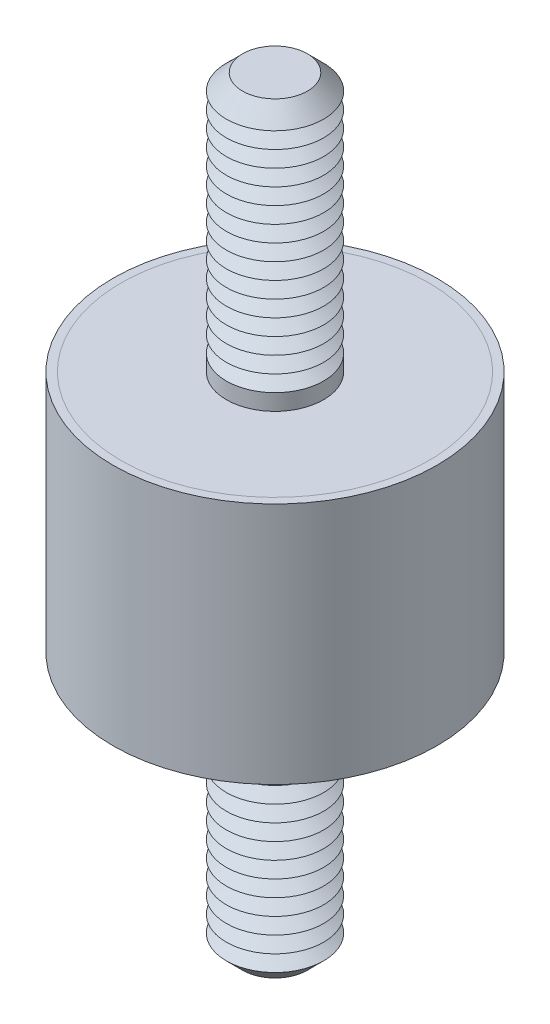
ISO-10303-21;
HEADER;
FILE_DESCRIPTION(('STEP AP214'),'2;1');
FILE_NAME('part.step','',(''),(''),'','','');
FILE_SCHEMA(('AUTOMOTIVE_DESIGN { 1 0 10303 214 1 1 1 1 }'));
ENDSEC;
DATA;
#1=APPLICATION_CONTEXT('core data for automotive mechanical design processes');
#2=APPLICATION_PROTOCOL_DEFINITION('international standard','automotive_design',2000,#1);
#3=PRODUCT_CONTEXT('',#1,'mechanical');
#4=PRODUCT('Part','Part','',(#3));
#5=PRODUCT_RELATED_PRODUCT_CATEGORY('part','',(#4));
#6=PRODUCT_DEFINITION_FORMATION('','',#4);
#7=PRODUCT_DEFINITION_CONTEXT('part definition',#1,'design');
#8=PRODUCT_DEFINITION('design','',#6,#7);
#9=PRODUCT_DEFINITION_SHAPE('','',#8);
#10=(LENGTH_UNIT() NAMED_UNIT(*) SI_UNIT(.MILLI.,.METRE.));
#11=(NAMED_UNIT(*) PLANE_ANGLE_UNIT() SI_UNIT($,.RADIAN.));
#12=(NAMED_UNIT(*) SI_UNIT($,.STERADIAN.) SOLID_ANGLE_UNIT());
#13=UNCERTAINTY_MEASURE_WITH_UNIT(LENGTH_MEASURE(1.E-05),#10,'distance_accuracy_value','');
#14=(GEOMETRIC_REPRESENTATION_CONTEXT(3) GLOBAL_UNCERTAINTY_ASSIGNED_CONTEXT((#13)) GLOBAL_UNIT_ASSIGNED_CONTEXT((#10,
#11,#12)) REPRESENTATION_CONTEXT('',''));
#15=CARTESIAN_POINT('',(0.,0.,0.));
#16=DIRECTION('',(0.,0.,1.));
#17=DIRECTION('',(1.,0.,0.));
#18=AXIS2_PLACEMENT_3D('',#15,#16,#17);
#19=CARTESIAN_POINT('',(0.,-23.5,0.));
#20=DIRECTION('',(0.,1.,0.));
#21=DIRECTION('',(0.,0.,1.));
#22=AXIS2_PLACEMENT_3D('',#19,#20,#21);
#23=CYLINDRICAL_SURFACE('',#22,3.);
#24=CARTESIAN_POINT('',(0.,-7.5,0.));
#25=DIRECTION('',(0.,-1.,0.));
#26=DIRECTION('',(0.,0.,-1.));
#27=AXIS2_PLACEMENT_3D('',#24,#25,#26);
#28=CIRCLE('',#27,3.);
#29=CARTESIAN_POINT('',(0.,-7.5,-3.));
#30=VERTEX_POINT('',#29);
#31=EDGE_CURVE('P0_E21',#30,#30,#28,.T.);
#32=ORIENTED_EDGE('',*,*,#31,.T.);
#33=EDGE_LOOP('',(#32));
#34=FACE_BOUND('',#33,.T.);
#35=CARTESIAN_POINT('',(0.,-8.5,0.));
#36=DIRECTION('',(0.,1.,0.));
#37=DIRECTION('',(0.,0.,1.));
#38=AXIS2_PLACEMENT_3D('',#35,#36,#37);
#39=CIRCLE('',#38,3.);
#40=CARTESIAN_POINT('',(0.,-8.5,3.));
#41=VERTEX_POINT('',#40);
#42=EDGE_CURVE('P0_E33',#41,#41,#39,.T.);
#43=ORIENTED_EDGE('',*,*,#42,.T.);
#44=EDGE_LOOP('',(#43));
#45=FACE_BOUND('',#44,.T.);
#46=ADVANCED_FACE('P0_F14',(#34,#45),#23,.T.);
#47=CARTESIAN_POINT('',(0.,-7.5,0.));
#48=DIRECTION('',(0.,1.,0.));
#49=DIRECTION('',(0.,0.,1.));
#50=AXIS2_PLACEMENT_3D('',#47,#48,#49);
#51=CYLINDRICAL_SURFACE('',#50,9.5);
#52=CARTESIAN_POINT('',(0.,-7.5,0.));
#53=DIRECTION('',(0.,1.,0.));
#54=DIRECTION('',(0.,0.,1.));
#55=AXIS2_PLACEMENT_3D('',#52,#53,#54);
#56=CIRCLE('',#55,9.5);
#57=CARTESIAN_POINT('',(0.,-7.5,9.5));
#58=VERTEX_POINT('',#57);
#59=EDGE_CURVE('P0_E25',#58,#58,#56,.T.);
#60=ORIENTED_EDGE('',*,*,#59,.T.);
#61=EDGE_LOOP('',(#60));
#62=FACE_BOUND('',#61,.T.);
#63=CARTESIAN_POINT('',(0.,-7.,0.));
#64=DIRECTION('',(0.,1.,0.));
#65=DIRECTION('',(0.,0.,1.));
#66=AXIS2_PLACEMENT_3D('',#63,#64,#65);
#67=CIRCLE('',#66,9.5);
#68=CARTESIAN_POINT('',(0.,-7.,9.5));
#69=VERTEX_POINT('',#68);
#70=EDGE_CURVE('P0_E30',#69,#69,#67,.T.);
#71=ORIENTED_EDGE('',*,*,#70,.F.);
#72=EDGE_LOOP('',(#71));
#73=FACE_BOUND('',#72,.T.);
#74=ADVANCED_FACE('P0_F145',(#62,#73),#51,.T.);
#75=CARTESIAN_POINT('',(0.,-7.5,0.));
#76=DIRECTION('',(0.,1.,0.));
#77=DIRECTION('',(0.,0.,1.));
#78=AXIS2_PLACEMENT_3D('',#75,#76,#77);
#79=PLANE('',#78);
#80=ORIENTED_EDGE('',*,*,#31,.F.);
#81=EDGE_LOOP('',(#80));
#82=FACE_BOUND('',#81,.T.);
#83=ORIENTED_EDGE('',*,*,#59,.F.);
#84=EDGE_LOOP('',(#83));
#85=FACE_BOUND('',#84,.T.);
#86=ADVANCED_FACE('P0_F150',(#82,#85),#79,.F.);
#87=CARTESIAN_POINT('',(0.,-7.,0.));
#88=DIRECTION('',(0.,1.,0.));
#89=DIRECTION('',(0.,0.,1.));
#90=AXIS2_PLACEMENT_3D('',#87,#88,#89);
#91=PLANE('',#90);
#92=ORIENTED_EDGE('',*,*,#70,.T.);
#93=EDGE_LOOP('',(#92));
#94=FACE_BOUND('',#93,.T.);
#95=ADVANCED_FACE('P0_F156',(#94),#91,.T.);
#96=CARTESIAN_POINT('',(0.,-8.5,0.));
#97=DIRECTION('',(0.,1.,0.));
#98=DIRECTION('',(0.,0.,1.));
#99=AXIS2_PLACEMENT_3D('',#96,#97,#98);
#100=CONICAL_SURFACE('',#99,3.,1.0471975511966);
#101=CARTESIAN_POINT('',(0.,-9.,0.));
#102=DIRECTION('',(0.,1.,0.));
#103=DIRECTION('',(0.,0.,1.));
#104=AXIS2_PLACEMENT_3D('',#101,#102,#103);
#105=CIRCLE('',#104,2.13397459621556);
#106=CARTESIAN_POINT('',(0.,-9.,2.13397459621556));
#107=VERTEX_POINT('',#106);
#108=EDGE_CURVE('P0_E39',#107,#107,#105,.T.);
#109=ORIENTED_EDGE('',*,*,#108,.T.);
#110=EDGE_LOOP('',(#109));
#111=FACE_BOUND('',#110,.T.);
#112=ORIENTED_EDGE('',*,*,#42,.F.);
#113=EDGE_LOOP('',(#112));
#114=FACE_BOUND('',#113,.T.);
#115=ADVANCED_FACE('P0_F159',(#111,#114),#100,.T.);
#116=CARTESIAN_POINT('',(0.,-9.,0.));
#117=DIRECTION('',(0.,-1.,0.));
#118=DIRECTION('',(0.,0.,-1.));
#119=AXIS2_PLACEMENT_3D('',#116,#117,#118);
#120=CONICAL_SURFACE('',#119,2.13397459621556,1.0471975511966);
#121=CARTESIAN_POINT('',(0.,-9.5,0.));
#122=DIRECTION('',(0.,1.,0.));
#123=DIRECTION('',(0.,0.,1.));
#124=AXIS2_PLACEMENT_3D('',#121,#122,#123);
#125=CIRCLE('',#124,3.);
#126=CARTESIAN_POINT('',(0.,-9.5,3.));
#127=VERTEX_POINT('',#126);
#128=EDGE_CURVE('P0_E43',#127,#127,#125,.T.);
#129=ORIENTED_EDGE('',*,*,#128,.T.);
#130=EDGE_LOOP('',(#129));
#131=FACE_BOUND('',#130,.T.);
#132=ORIENTED_EDGE('',*,*,#108,.F.);
#133=EDGE_LOOP('',(#132));
#134=FACE_BOUND('',#133,.T.);
#135=ADVANCED_FACE('P0_F163',(#131,#134),#120,.T.);
#136=CARTESIAN_POINT('',(0.,-9.5,0.));
#137=DIRECTION('',(0.,1.,0.));
#138=DIRECTION('',(0.,0.,1.));
#139=AXIS2_PLACEMENT_3D('',#136,#137,#138);
#140=CONICAL_SURFACE('',#139,3.,1.0471975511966);
#141=CARTESIAN_POINT('',(0.,-10.,0.));
#142=DIRECTION('',(0.,1.,0.));
#143=DIRECTION('',(0.,0.,1.));
#144=AXIS2_PLACEMENT_3D('',#141,#142,#143);
#145=CIRCLE('',#144,2.13397459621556);
#146=CARTESIAN_POINT('',(0.,-10.,2.13397459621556));
#147=VERTEX_POINT('',#146);
#148=EDGE_CURVE('P0_E47',#147,#147,#145,.T.);
#149=ORIENTED_EDGE('',*,*,#148,.T.);
#150=EDGE_LOOP('',(#149));
#151=FACE_BOUND('',#150,.T.);
#152=ORIENTED_EDGE('',*,*,#128,.F.);
#153=EDGE_LOOP('',(#152));
#154=FACE_BOUND('',#153,.T.);
#155=ADVANCED_FACE('P0_F167',(#151,#154),#140,.T.);
#156=CARTESIAN_POINT('',(0.,-10.,0.));
#157=DIRECTION('',(0.,-1.,0.));
#158=DIRECTION('',(0.,0.,-1.));
#159=AXIS2_PLACEMENT_3D('',#156,#157,#158);
#160=CONICAL_SURFACE('',#159,2.13397459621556,1.0471975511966);
#161=CARTESIAN_POINT('',(0.,-10.5,0.));
#162=DIRECTION('',(0.,1.,0.));
#163=DIRECTION('',(0.,0.,1.));
#164=AXIS2_PLACEMENT_3D('',#161,#162,#163);
#165=CIRCLE('',#164,3.);
#166=CARTESIAN_POINT('',(0.,-10.5,3.));
#167=VERTEX_POINT('',#166);
#168=EDGE_CURVE('P0_E52',#167,#167,#165,.T.);
#169=ORIENTED_EDGE('',*,*,#168,.T.);
#170=EDGE_LOOP('',(#169));
#171=FACE_BOUND('',#170,.T.);
#172=ORIENTED_EDGE('',*,*,#148,.F.);
#173=EDGE_LOOP('',(#172));
#174=FACE_BOUND('',#173,.T.);
#175=ADVANCED_FACE('P0_F174',(#171,#174),#160,.T.);
#176=CARTESIAN_POINT('',(0.,-10.5,0.));
#177=DIRECTION('',(0.,1.,0.));
#178=DIRECTION('',(0.,0.,1.));
#179=AXIS2_PLACEMENT_3D('',#176,#177,#178);
#180=CONICAL_SURFACE('',#179,3.,1.0471975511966);
#181=CARTESIAN_POINT('',(0.,-11.,0.));
#182=DIRECTION('',(0.,1.,0.));
#183=DIRECTION('',(0.,0.,1.));
#184=AXIS2_PLACEMENT_3D('',#181,#182,#183);
#185=CIRCLE('',#184,2.13397459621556);
#186=CARTESIAN_POINT('',(0.,-11.,2.13397459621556));
#187=VERTEX_POINT('',#186);
#188=EDGE_CURVE('P0_E55',#187,#187,#185,.T.);
#189=ORIENTED_EDGE('',*,*,#188,.T.);
#190=EDGE_LOOP('',(#189));
#191=FACE_BOUND('',#190,.T.);
#192=ORIENTED_EDGE('',*,*,#168,.F.);
#193=EDGE_LOOP('',(#192));
#194=FACE_BOUND('',#193,.T.);
#195=ADVANCED_FACE('P0_F178',(#191,#194),#180,.T.);
#196=CARTESIAN_POINT('',(0.,-11.,0.));
#197=DIRECTION('',(0.,-1.,0.));
#198=DIRECTION('',(0.,0.,-1.));
#199=AXIS2_PLACEMENT_3D('',#196,#197,#198);
#200=CONICAL_SURFACE('',#199,2.13397459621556,1.0471975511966);
#201=CARTESIAN_POINT('',(0.,-11.5,0.));
#202=DIRECTION('',(0.,1.,0.));
#203=DIRECTION('',(0.,0.,1.));
#204=AXIS2_PLACEMENT_3D('',#201,#202,#203);
#205=CIRCLE('',#204,3.);
#206=CARTESIAN_POINT('',(0.,-11.5,3.));
#207=VERTEX_POINT('',#206);
#208=EDGE_CURVE('P0_E58',#207,#207,#205,.T.);
#209=ORIENTED_EDGE('',*,*,#208,.T.);
#210=EDGE_LOOP('',(#209));
#211=FACE_BOUND('',#210,.T.);
#212=ORIENTED_EDGE('',*,*,#188,.F.);
#213=EDGE_LOOP('',(#212));
#214=FACE_BOUND('',#213,.T.);
#215=ADVANCED_FACE('P0_F182',(#211,#214),#200,.T.);
#216=CARTESIAN_POINT('',(0.,-11.5,0.));
#217=DIRECTION('',(0.,1.,0.));
#218=DIRECTION('',(0.,0.,1.));
#219=AXIS2_PLACEMENT_3D('',#216,#217,#218);
#220=CONICAL_SURFACE('',#219,3.,1.0471975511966);
#221=CARTESIAN_POINT('',(0.,-12.,0.));
#222=DIRECTION('',(0.,1.,0.));
#223=DIRECTION('',(0.,0.,1.));
#224=AXIS2_PLACEMENT_3D('',#221,#222,#223);
#225=CIRCLE('',#224,2.13397459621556);
#226=CARTESIAN_POINT('',(0.,-12.,2.13397459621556));
#227=VERTEX_POINT('',#226);
#228=EDGE_CURVE('P0_E61',#227,#227,#225,.T.);
#229=ORIENTED_EDGE('',*,*,#228,.T.);
#230=EDGE_LOOP('',(#229));
#231=FACE_BOUND('',#230,.T.);
#232=ORIENTED_EDGE('',*,*,#208,.F.);
#233=EDGE_LOOP('',(#232));
#234=FACE_BOUND('',#233,.T.);
#235=ADVANCED_FACE('P0_F186',(#231,#234),#220,.T.);
#236=CARTESIAN_POINT('',(0.,-12.,0.));
#237=DIRECTION('',(0.,-1.,0.));
#238=DIRECTION('',(0.,0.,-1.));
#239=AXIS2_PLACEMENT_3D('',#236,#237,#238);
#240=CONICAL_SURFACE('',#239,2.13397459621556,1.0471975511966);
#241=CARTESIAN_POINT('',(0.,-12.5,0.));
#242=DIRECTION('',(0.,1.,0.));
#243=DIRECTION('',(0.,0.,1.));
#244=AXIS2_PLACEMENT_3D('',#241,#242,#243);
#245=CIRCLE('',#244,3.);
#246=CARTESIAN_POINT('',(0.,-12.5,3.));
#247=VERTEX_POINT('',#246);
#248=EDGE_CURVE('P0_E64',#247,#247,#245,.T.);
#249=ORIENTED_EDGE('',*,*,#248,.T.);
#250=EDGE_LOOP('',(#249));
#251=FACE_BOUND('',#250,.T.);
#252=ORIENTED_EDGE('',*,*,#228,.F.);
#253=EDGE_LOOP('',(#252));
#254=FACE_BOUND('',#253,.T.);
#255=ADVANCED_FACE('P0_F190',(#251,#254),#240,.T.);
#256=CARTESIAN_POINT('',(0.,-12.5,0.));
#257=DIRECTION('',(0.,1.,0.));
#258=DIRECTION('',(0.,0.,1.));
#259=AXIS2_PLACEMENT_3D('',#256,#257,#258);
#260=CONICAL_SURFACE('',#259,3.,1.0471975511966);
#261=CARTESIAN_POINT('',(0.,-13.,0.));
#262=DIRECTION('',(0.,1.,0.));
#263=DIRECTION('',(0.,0.,1.));
#264=AXIS2_PLACEMENT_3D('',#261,#262,#263);
#265=CIRCLE('',#264,2.13397459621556);
#266=CARTESIAN_POINT('',(0.,-13.,2.13397459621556));
#267=VERTEX_POINT('',#266);
#268=EDGE_CURVE('P0_E67',#267,#267,#265,.T.);
#269=ORIENTED_EDGE('',*,*,#268,.T.);
#270=EDGE_LOOP('',(#269));
#271=FACE_BOUND('',#270,.T.);
#272=ORIENTED_EDGE('',*,*,#248,.F.);
#273=EDGE_LOOP('',(#272));
#274=FACE_BOUND('',#273,.T.);
#275=ADVANCED_FACE('P0_F194',(#271,#274),#260,.T.);
#276=CARTESIAN_POINT('',(0.,-13.,0.));
#277=DIRECTION('',(0.,-1.,0.));
#278=DIRECTION('',(0.,0.,-1.));
#279=AXIS2_PLACEMENT_3D('',#276,#277,#278);
#280=CONICAL_SURFACE('',#279,2.13397459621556,1.0471975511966);
#281=CARTESIAN_POINT('',(0.,-13.5,0.));
#282=DIRECTION('',(0.,1.,0.));
#283=DIRECTION('',(0.,0.,1.));
#284=AXIS2_PLACEMENT_3D('',#281,#282,#283);
#285=CIRCLE('',#284,3.);
#286=CARTESIAN_POINT('',(0.,-13.5,3.));
#287=VERTEX_POINT('',#286);
#288=EDGE_CURVE('P0_E70',#287,#287,#285,.T.);
#289=ORIENTED_EDGE('',*,*,#288,.T.);
#290=EDGE_LOOP('',(#289));
#291=FACE_BOUND('',#290,.T.);
#292=ORIENTED_EDGE('',*,*,#268,.F.);
#293=EDGE_LOOP('',(#292));
#294=FACE_BOUND('',#293,.T.);
#295=ADVANCED_FACE('P0_F198',(#291,#294),#280,.T.);
#296=CARTESIAN_POINT('',(0.,-13.5,0.));
#297=DIRECTION('',(0.,1.,0.));
#298=DIRECTION('',(0.,0.,1.));
#299=AXIS2_PLACEMENT_3D('',#296,#297,#298);
#300=CONICAL_SURFACE('',#299,3.,1.0471975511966);
#301=CARTESIAN_POINT('',(0.,-14.,0.));
#302=DIRECTION('',(0.,1.,0.));
#303=DIRECTION('',(0.,0.,1.));
#304=AXIS2_PLACEMENT_3D('',#301,#302,#303);
#305=CIRCLE('',#304,2.13397459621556);
#306=CARTESIAN_POINT('',(0.,-14.,2.13397459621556));
#307=VERTEX_POINT('',#306);
#308=EDGE_CURVE('P0_E73',#307,#307,#305,.T.);
#309=ORIENTED_EDGE('',*,*,#308,.T.);
#310=EDGE_LOOP('',(#309));
#311=FACE_BOUND('',#310,.T.);
#312=ORIENTED_EDGE('',*,*,#288,.F.);
#313=EDGE_LOOP('',(#312));
#314=FACE_BOUND('',#313,.T.);
#315=ADVANCED_FACE('P0_F202',(#311,#314),#300,.T.);
#316=CARTESIAN_POINT('',(0.,-14.,0.));
#317=DIRECTION('',(0.,-1.,0.));
#318=DIRECTION('',(0.,0.,-1.));
#319=AXIS2_PLACEMENT_3D('',#316,#317,#318);
#320=CONICAL_SURFACE('',#319,2.13397459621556,1.0471975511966);
#321=CARTESIAN_POINT('',(0.,-14.5,0.));
#322=DIRECTION('',(0.,1.,0.));
#323=DIRECTION('',(0.,0.,1.));
#324=AXIS2_PLACEMENT_3D('',#321,#322,#323);
#325=CIRCLE('',#324,3.);
#326=CARTESIAN_POINT('',(0.,-14.5,3.));
#327=VERTEX_POINT('',#326);
#328=EDGE_CURVE('P0_E76',#327,#327,#325,.T.);
#329=ORIENTED_EDGE('',*,*,#328,.T.);
#330=EDGE_LOOP('',(#329));
#331=FACE_BOUND('',#330,.T.);
#332=ORIENTED_EDGE('',*,*,#308,.F.);
#333=EDGE_LOOP('',(#332));
#334=FACE_BOUND('',#333,.T.);
#335=ADVANCED_FACE('P0_F206',(#331,#334),#320,.T.);
#336=CARTESIAN_POINT('',(0.,-14.5,0.));
#337=DIRECTION('',(0.,1.,0.));
#338=DIRECTION('',(0.,0.,1.));
#339=AXIS2_PLACEMENT_3D('',#336,#337,#338);
#340=CONICAL_SURFACE('',#339,3.,1.0471975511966);
#341=CARTESIAN_POINT('',(0.,-15.,0.));
#342=DIRECTION('',(0.,1.,0.));
#343=DIRECTION('',(0.,0.,1.));
#344=AXIS2_PLACEMENT_3D('',#341,#342,#343);
#345=CIRCLE('',#344,2.13397459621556);
#346=CARTESIAN_POINT('',(0.,-15.,2.13397459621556));
#347=VERTEX_POINT('',#346);
#348=EDGE_CURVE('P0_E79',#347,#347,#345,.T.);
#349=ORIENTED_EDGE('',*,*,#348,.T.);
#350=EDGE_LOOP('',(#349));
#351=FACE_BOUND('',#350,.T.);
#352=ORIENTED_EDGE('',*,*,#328,.F.);
#353=EDGE_LOOP('',(#352));
#354=FACE_BOUND('',#353,.T.);
#355=ADVANCED_FACE('P0_F210',(#351,#354),#340,.T.);
#356=CARTESIAN_POINT('',(0.,-15.,0.));
#357=DIRECTION('',(0.,-1.,0.));
#358=DIRECTION('',(0.,0.,-1.));
#359=AXIS2_PLACEMENT_3D('',#356,#357,#358);
#360=CONICAL_SURFACE('',#359,2.13397459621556,1.0471975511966);
#361=CARTESIAN_POINT('',(0.,-15.5,0.));
#362=DIRECTION('',(0.,1.,0.));
#363=DIRECTION('',(0.,0.,1.));
#364=AXIS2_PLACEMENT_3D('',#361,#362,#363);
#365=CIRCLE('',#364,3.);
#366=CARTESIAN_POINT('',(0.,-15.5,3.));
#367=VERTEX_POINT('',#366);
#368=EDGE_CURVE('P0_E82',#367,#367,#365,.T.);
#369=ORIENTED_EDGE('',*,*,#368,.T.);
#370=EDGE_LOOP('',(#369));
#371=FACE_BOUND('',#370,.T.);
#372=ORIENTED_EDGE('',*,*,#348,.F.);
#373=EDGE_LOOP('',(#372));
#374=FACE_BOUND('',#373,.T.);
#375=ADVANCED_FACE('P0_F214',(#371,#374),#360,.T.);
#376=CARTESIAN_POINT('',(0.,-15.5,0.));
#377=DIRECTION('',(0.,1.,0.));
#378=DIRECTION('',(0.,0.,1.));
#379=AXIS2_PLACEMENT_3D('',#376,#377,#378);
#380=CONICAL_SURFACE('',#379,3.,1.0471975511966);
#381=CARTESIAN_POINT('',(0.,-16.,0.));
#382=DIRECTION('',(0.,1.,0.));
#383=DIRECTION('',(0.,0.,1.));
#384=AXIS2_PLACEMENT_3D('',#381,#382,#383);
#385=CIRCLE('',#384,2.13397459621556);
#386=CARTESIAN_POINT('',(0.,-16.,2.13397459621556));
#387=VERTEX_POINT('',#386);
#388=EDGE_CURVE('P0_E85',#387,#387,#385,.T.);
#389=ORIENTED_EDGE('',*,*,#388,.T.);
#390=EDGE_LOOP('',(#389));
#391=FACE_BOUND('',#390,.T.);
#392=ORIENTED_EDGE('',*,*,#368,.F.);
#393=EDGE_LOOP('',(#392));
#394=FACE_BOUND('',#393,.T.);
#395=ADVANCED_FACE('P0_F218',(#391,#394),#380,.T.);
#396=CARTESIAN_POINT('',(0.,-16.,0.));
#397=DIRECTION('',(0.,-1.,0.));
#398=DIRECTION('',(0.,0.,-1.));
#399=AXIS2_PLACEMENT_3D('',#396,#397,#398);
#400=CONICAL_SURFACE('',#399,2.13397459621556,1.0471975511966);
#401=CARTESIAN_POINT('',(0.,-16.5,0.));
#402=DIRECTION('',(0.,1.,0.));
#403=DIRECTION('',(0.,0.,1.));
#404=AXIS2_PLACEMENT_3D('',#401,#402,#403);
#405=CIRCLE('',#404,3.);
#406=CARTESIAN_POINT('',(0.,-16.5,3.));
#407=VERTEX_POINT('',#406);
#408=EDGE_CURVE('P0_E88',#407,#407,#405,.T.);
#409=ORIENTED_EDGE('',*,*,#408,.T.);
#410=EDGE_LOOP('',(#409));
#411=FACE_BOUND('',#410,.T.);
#412=ORIENTED_EDGE('',*,*,#388,.F.);
#413=EDGE_LOOP('',(#412));
#414=FACE_BOUND('',#413,.T.);
#415=ADVANCED_FACE('P0_F222',(#411,#414),#400,.T.);
#416=CARTESIAN_POINT('',(0.,-16.5,0.));
#417=DIRECTION('',(0.,1.,0.));
#418=DIRECTION('',(0.,0.,1.));
#419=AXIS2_PLACEMENT_3D('',#416,#417,#418);
#420=CONICAL_SURFACE('',#419,3.,1.0471975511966);
#421=CARTESIAN_POINT('',(0.,-17.,0.));
#422=DIRECTION('',(0.,1.,0.));
#423=DIRECTION('',(0.,0.,1.));
#424=AXIS2_PLACEMENT_3D('',#421,#422,#423);
#425=CIRCLE('',#424,2.13397459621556);
#426=CARTESIAN_POINT('',(0.,-17.,2.13397459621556));
#427=VERTEX_POINT('',#426);
#428=EDGE_CURVE('P0_E91',#427,#427,#425,.T.);
#429=ORIENTED_EDGE('',*,*,#428,.T.);
#430=EDGE_LOOP('',(#429));
#431=FACE_BOUND('',#430,.T.);
#432=ORIENTED_EDGE('',*,*,#408,.F.);
#433=EDGE_LOOP('',(#432));
#434=FACE_BOUND('',#433,.T.);
#435=ADVANCED_FACE('P0_F226',(#431,#434),#420,.T.);
#436=CARTESIAN_POINT('',(0.,-17.,0.));
#437=DIRECTION('',(0.,-1.,0.));
#438=DIRECTION('',(0.,0.,-1.));
#439=AXIS2_PLACEMENT_3D('',#436,#437,#438);
#440=CONICAL_SURFACE('',#439,2.13397459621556,1.0471975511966);
#441=CARTESIAN_POINT('',(0.,-17.5,0.));
#442=DIRECTION('',(0.,1.,0.));
#443=DIRECTION('',(0.,0.,1.));
#444=AXIS2_PLACEMENT_3D('',#441,#442,#443);
#445=CIRCLE('',#444,3.);
#446=CARTESIAN_POINT('',(0.,-17.5,3.));
#447=VERTEX_POINT('',#446);
#448=EDGE_CURVE('P0_E94',#447,#447,#445,.T.);
#449=ORIENTED_EDGE('',*,*,#448,.T.);
#450=EDGE_LOOP('',(#449));
#451=FACE_BOUND('',#450,.T.);
#452=ORIENTED_EDGE('',*,*,#428,.F.);
#453=EDGE_LOOP('',(#452));
#454=FACE_BOUND('',#453,.T.);
#455=ADVANCED_FACE('P0_F230',(#451,#454),#440,.T.);
#456=CARTESIAN_POINT('',(0.,-17.5,0.));
#457=DIRECTION('',(0.,1.,0.));
#458=DIRECTION('',(0.,0.,1.));
#459=AXIS2_PLACEMENT_3D('',#456,#457,#458);
#460=CONICAL_SURFACE('',#459,3.,1.0471975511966);
#461=CARTESIAN_POINT('',(0.,-18.,0.));
#462=DIRECTION('',(0.,1.,0.));
#463=DIRECTION('',(0.,0.,1.));
#464=AXIS2_PLACEMENT_3D('',#461,#462,#463);
#465=CIRCLE('',#464,2.13397459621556);
#466=CARTESIAN_POINT('',(0.,-18.,2.13397459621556));
#467=VERTEX_POINT('',#466);
#468=EDGE_CURVE('P0_E97',#467,#467,#465,.T.);
#469=ORIENTED_EDGE('',*,*,#468,.T.);
#470=EDGE_LOOP('',(#469));
#471=FACE_BOUND('',#470,.T.);
#472=ORIENTED_EDGE('',*,*,#448,.F.);
#473=EDGE_LOOP('',(#472));
#474=FACE_BOUND('',#473,.T.);
#475=ADVANCED_FACE('P0_F234',(#471,#474),#460,.T.);
#476=CARTESIAN_POINT('',(0.,-18.,0.));
#477=DIRECTION('',(0.,-1.,0.));
#478=DIRECTION('',(0.,0.,-1.));
#479=AXIS2_PLACEMENT_3D('',#476,#477,#478);
#480=CONICAL_SURFACE('',#479,2.13397459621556,1.0471975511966);
#481=CARTESIAN_POINT('',(0.,-18.5,0.));
#482=DIRECTION('',(0.,1.,0.));
#483=DIRECTION('',(0.,0.,1.));
#484=AXIS2_PLACEMENT_3D('',#481,#482,#483);
#485=CIRCLE('',#484,3.);
#486=CARTESIAN_POINT('',(0.,-18.5,3.));
#487=VERTEX_POINT('',#486);
#488=EDGE_CURVE('P0_E100',#487,#487,#485,.T.);
#489=ORIENTED_EDGE('',*,*,#488,.T.);
#490=EDGE_LOOP('',(#489));
#491=FACE_BOUND('',#490,.T.);
#492=ORIENTED_EDGE('',*,*,#468,.F.);
#493=EDGE_LOOP('',(#492));
#494=FACE_BOUND('',#493,.T.);
#495=ADVANCED_FACE('P0_F238',(#491,#494),#480,.T.);
#496=CARTESIAN_POINT('',(0.,-18.5,0.));
#497=DIRECTION('',(0.,1.,0.));
#498=DIRECTION('',(0.,0.,1.));
#499=AXIS2_PLACEMENT_3D('',#496,#497,#498);
#500=CONICAL_SURFACE('',#499,3.,1.0471975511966);
#501=CARTESIAN_POINT('',(0.,-19.,0.));
#502=DIRECTION('',(0.,1.,0.));
#503=DIRECTION('',(0.,0.,1.));
#504=AXIS2_PLACEMENT_3D('',#501,#502,#503);
#505=CIRCLE('',#504,2.13397459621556);
#506=CARTESIAN_POINT('',(0.,-19.,2.13397459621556));
#507=VERTEX_POINT('',#506);
#508=EDGE_CURVE('P0_E103',#507,#507,#505,.T.);
#509=ORIENTED_EDGE('',*,*,#508,.T.);
#510=EDGE_LOOP('',(#509));
#511=FACE_BOUND('',#510,.T.);
#512=ORIENTED_EDGE('',*,*,#488,.F.);
#513=EDGE_LOOP('',(#512));
#514=FACE_BOUND('',#513,.T.);
#515=ADVANCED_FACE('P0_F242',(#511,#514),#500,.T.);
#516=CARTESIAN_POINT('',(0.,-19.,0.));
#517=DIRECTION('',(0.,-1.,0.));
#518=DIRECTION('',(0.,0.,-1.));
#519=AXIS2_PLACEMENT_3D('',#516,#517,#518);
#520=CONICAL_SURFACE('',#519,2.13397459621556,1.0471975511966);
#521=CARTESIAN_POINT('',(0.,-19.5,0.));
#522=DIRECTION('',(0.,1.,0.));
#523=DIRECTION('',(0.,0.,1.));
#524=AXIS2_PLACEMENT_3D('',#521,#522,#523);
#525=CIRCLE('',#524,3.);
#526=CARTESIAN_POINT('',(0.,-19.5,3.));
#527=VERTEX_POINT('',#526);
#528=EDGE_CURVE('P0_E106',#527,#527,#525,.T.);
#529=ORIENTED_EDGE('',*,*,#528,.T.);
#530=EDGE_LOOP('',(#529));
#531=FACE_BOUND('',#530,.T.);
#532=ORIENTED_EDGE('',*,*,#508,.F.);
#533=EDGE_LOOP('',(#532));
#534=FACE_BOUND('',#533,.T.);
#535=ADVANCED_FACE('P0_F246',(#531,#534),#520,.T.);
#536=CARTESIAN_POINT('',(0.,-19.5,0.));
#537=DIRECTION('',(0.,1.,0.));
#538=DIRECTION('',(0.,0.,1.));
#539=AXIS2_PLACEMENT_3D('',#536,#537,#538);
#540=CONICAL_SURFACE('',#539,3.,1.0471975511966);
#541=CARTESIAN_POINT('',(0.,-20.,0.));
#542=DIRECTION('',(0.,1.,0.));
#543=DIRECTION('',(0.,0.,1.));
#544=AXIS2_PLACEMENT_3D('',#541,#542,#543);
#545=CIRCLE('',#544,2.13397459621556);
#546=CARTESIAN_POINT('',(0.,-20.,2.13397459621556));
#547=VERTEX_POINT('',#546);
#548=EDGE_CURVE('P0_E109',#547,#547,#545,.T.);
#549=ORIENTED_EDGE('',*,*,#548,.T.);
#550=EDGE_LOOP('',(#549));
#551=FACE_BOUND('',#550,.T.);
#552=ORIENTED_EDGE('',*,*,#528,.F.);
#553=EDGE_LOOP('',(#552));
#554=FACE_BOUND('',#553,.T.);
#555=ADVANCED_FACE('P0_F250',(#551,#554),#540,.T.);
#556=CARTESIAN_POINT('',(0.,-20.,0.));
#557=DIRECTION('',(0.,-1.,0.));
#558=DIRECTION('',(0.,0.,-1.));
#559=AXIS2_PLACEMENT_3D('',#556,#557,#558);
#560=CONICAL_SURFACE('',#559,2.13397459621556,1.0471975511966);
#561=CARTESIAN_POINT('',(0.,-20.5,0.));
#562=DIRECTION('',(0.,1.,0.));
#563=DIRECTION('',(0.,0.,1.));
#564=AXIS2_PLACEMENT_3D('',#561,#562,#563);
#565=CIRCLE('',#564,3.);
#566=CARTESIAN_POINT('',(0.,-20.5,3.));
#567=VERTEX_POINT('',#566);
#568=EDGE_CURVE('P0_E112',#567,#567,#565,.T.);
#569=ORIENTED_EDGE('',*,*,#568,.T.);
#570=EDGE_LOOP('',(#569));
#571=FACE_BOUND('',#570,.T.);
#572=ORIENTED_EDGE('',*,*,#548,.F.);
#573=EDGE_LOOP('',(#572));
#574=FACE_BOUND('',#573,.T.);
#575=ADVANCED_FACE('P0_F254',(#571,#574),#560,.T.);
#576=CARTESIAN_POINT('',(0.,-20.5,0.));
#577=DIRECTION('',(0.,1.,0.));
#578=DIRECTION('',(0.,0.,1.));
#579=AXIS2_PLACEMENT_3D('',#576,#577,#578);
#580=CONICAL_SURFACE('',#579,3.,1.0471975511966);
#581=CARTESIAN_POINT('',(0.,-21.,0.));
#582=DIRECTION('',(0.,1.,0.));
#583=DIRECTION('',(0.,0.,1.));
#584=AXIS2_PLACEMENT_3D('',#581,#582,#583);
#585=CIRCLE('',#584,2.13397459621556);
#586=CARTESIAN_POINT('',(0.,-21.,2.13397459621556));
#587=VERTEX_POINT('',#586);
#588=EDGE_CURVE('P0_E115',#587,#587,#585,.T.);
#589=ORIENTED_EDGE('',*,*,#588,.T.);
#590=EDGE_LOOP('',(#589));
#591=FACE_BOUND('',#590,.T.);
#592=ORIENTED_EDGE('',*,*,#568,.F.);
#593=EDGE_LOOP('',(#592));
#594=FACE_BOUND('',#593,.T.);
#595=ADVANCED_FACE('P0_F258',(#591,#594),#580,.T.);
#596=CARTESIAN_POINT('',(0.,-21.,0.));
#597=DIRECTION('',(0.,-1.,0.));
#598=DIRECTION('',(0.,0.,-1.));
#599=AXIS2_PLACEMENT_3D('',#596,#597,#598);
#600=CONICAL_SURFACE('',#599,2.13397459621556,1.0471975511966);
#601=CARTESIAN_POINT('',(0.,-21.5,0.));
#602=DIRECTION('',(0.,1.,0.));
#603=DIRECTION('',(0.,0.,1.));
#604=AXIS2_PLACEMENT_3D('',#601,#602,#603);
#605=CIRCLE('',#604,3.);
#606=CARTESIAN_POINT('',(0.,-21.5,3.));
#607=VERTEX_POINT('',#606);
#608=EDGE_CURVE('P0_E118',#607,#607,#605,.T.);
#609=ORIENTED_EDGE('',*,*,#608,.T.);
#610=EDGE_LOOP('',(#609));
#611=FACE_BOUND('',#610,.T.);
#612=ORIENTED_EDGE('',*,*,#588,.F.);
#613=EDGE_LOOP('',(#612));
#614=FACE_BOUND('',#613,.T.);
#615=ADVANCED_FACE('P0_F142',(#611,#614),#600,.T.);
#616=CARTESIAN_POINT('',(0.,-21.5,0.));
#617=DIRECTION('',(0.,1.,0.));
#618=DIRECTION('',(0.,0.,1.));
#619=AXIS2_PLACEMENT_3D('',#616,#617,#618);
#620=CONICAL_SURFACE('',#619,3.,1.0471975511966);
#621=CARTESIAN_POINT('',(0.,-22.,0.));
#622=DIRECTION('',(0.,1.,0.));
#623=DIRECTION('',(0.,0.,1.));
#624=AXIS2_PLACEMENT_3D('',#621,#622,#623);
#625=CIRCLE('',#624,2.13397459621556);
#626=CARTESIAN_POINT('',(0.,-22.,2.13397459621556));
#627=VERTEX_POINT('',#626);
#628=EDGE_CURVE('P0_E124',#627,#627,#625,.T.);
#629=ORIENTED_EDGE('',*,*,#628,.T.);
#630=EDGE_LOOP('',(#629));
#631=FACE_BOUND('',#630,.T.);
#632=ORIENTED_EDGE('',*,*,#608,.F.);
#633=EDGE_LOOP('',(#632));
#634=FACE_BOUND('',#633,.T.);
#635=ADVANCED_FACE('P0_F128',(#631,#634),#620,.T.);
#636=CARTESIAN_POINT('',(0.,-22.,0.));
#637=DIRECTION('',(0.,-1.,0.));
#638=DIRECTION('',(0.,0.,-1.));
#639=AXIS2_PLACEMENT_3D('',#636,#637,#638);
#640=CONICAL_SURFACE('',#639,2.13397459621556,1.0471975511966);
#641=CARTESIAN_POINT('',(0.,-22.5,0.));
#642=DIRECTION('',(0.,1.,0.));
#643=DIRECTION('',(0.,0.,1.));
#644=AXIS2_PLACEMENT_3D('',#641,#642,#643);
#645=CIRCLE('',#644,3.);
#646=CARTESIAN_POINT('',(0.,-22.5,3.));
#647=VERTEX_POINT('',#646);
#648=EDGE_CURVE('P0_E121',#647,#647,#645,.T.);
#649=ORIENTED_EDGE('',*,*,#648,.T.);
#650=EDGE_LOOP('',(#649));
#651=FACE_BOUND('',#650,.T.);
#652=ORIENTED_EDGE('',*,*,#628,.F.);
#653=EDGE_LOOP('',(#652));
#654=FACE_BOUND('',#653,.T.);
#655=ADVANCED_FACE('P0_F131',(#651,#654),#640,.T.);
#656=CARTESIAN_POINT('',(0.,-23.5,0.));
#657=DIRECTION('',(0.,-1.,0.));
#658=DIRECTION('',(0.,0.,-1.));
#659=AXIS2_PLACEMENT_3D('',#656,#657,#658);
#660=PLANE('',#659);
#661=CARTESIAN_POINT('',(0.,-23.5,0.));
#662=DIRECTION('',(0.,-1.,0.));
#663=DIRECTION('',(0.,0.,-1.));
#664=AXIS2_PLACEMENT_3D('',#661,#662,#663);
#665=CIRCLE('',#664,2.);
#666=CARTESIAN_POINT('',(0.,-23.5,-2.));
#667=VERTEX_POINT('',#666);
#668=EDGE_CURVE('P0_E10',#667,#667,#665,.T.);
#669=ORIENTED_EDGE('',*,*,#668,.T.);
#670=EDGE_LOOP('',(#669));
#671=FACE_BOUND('',#670,.T.);
#672=ADVANCED_FACE('P0_F133',(#671),#660,.T.);
#673=CARTESIAN_POINT('',(0.,-23.5,0.));
#674=DIRECTION('',(0.,1.,0.));
#675=DIRECTION('',(0.,0.,1.));
#676=AXIS2_PLACEMENT_3D('',#673,#674,#675);
#677=CONICAL_SURFACE('',#676,2.,0.785398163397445);
#678=ORIENTED_EDGE('',*,*,#648,.F.);
#679=EDGE_LOOP('',(#678));
#680=FACE_BOUND('',#679,.T.);
#681=ORIENTED_EDGE('',*,*,#668,.F.);
#682=EDGE_LOOP('',(#681));
#683=FACE_BOUND('',#682,.T.);
#684=ADVANCED_FACE('P0_F16',(#680,#683),#677,.T.);
#685=CLOSED_SHELL('',(#46,#74,#86,#95,#115,#135,#155,#175,#195,#215,#235,#255,#275,#295,#315,
#335,#355,#375,#395,#415,#435,#455,#475,#495,#515,#535,#555,#575,#595,#615,#635,#655,#672,#684));
#686=MANIFOLD_SOLID_BREP('P0_B1',#685);
#687=CARTESIAN_POINT('',(0.,23.5,0.));
#688=DIRECTION('',(0.,-1.,0.));
#689=DIRECTION('',(0.,0.,-1.));
#690=AXIS2_PLACEMENT_3D('',#687,#688,#689);
#691=CYLINDRICAL_SURFACE('',#690,3.);
#692=CARTESIAN_POINT('',(0.,8.5,0.));
#693=DIRECTION('',(0.,1.,0.));
#694=DIRECTION('',(0.,0.,1.));
#695=AXIS2_PLACEMENT_3D('',#692,#693,#694);
#696=CIRCLE('',#695,3.);
#697=CARTESIAN_POINT('',(0.,8.5,3.));
#698=VERTEX_POINT('',#697);
#699=EDGE_CURVE('P1_E33',#698,#698,#696,.T.);
#700=ORIENTED_EDGE('',*,*,#699,.F.);
#701=EDGE_LOOP('',(#700));
#702=FACE_BOUND('',#701,.T.);
#703=CARTESIAN_POINT('',(0.,7.5,0.));
#704=DIRECTION('',(0.,1.,0.));
#705=DIRECTION('',(0.,0.,1.));
#706=AXIS2_PLACEMENT_3D('',#703,#704,#705);
#707=CIRCLE('',#706,3.);
#708=CARTESIAN_POINT('',(0.,7.5,3.));
#709=VERTEX_POINT('',#708);
#710=EDGE_CURVE('P1_E21',#709,#709,#707,.T.);
#711=ORIENTED_EDGE('',*,*,#710,.T.);
#712=EDGE_LOOP('',(#711));
#713=FACE_BOUND('',#712,.T.);
#714=ADVANCED_FACE('P1_F14',(#702,#713),#691,.T.);
#715=CARTESIAN_POINT('',(0.,7.5,0.));
#716=DIRECTION('',(0.,-1.,0.));
#717=DIRECTION('',(0.,0.,-1.));
#718=AXIS2_PLACEMENT_3D('',#715,#716,#717);
#719=CYLINDRICAL_SURFACE('',#718,9.5);
#720=CARTESIAN_POINT('',(0.,7.5,0.));
#721=DIRECTION('',(0.,1.,0.));
#722=DIRECTION('',(0.,0.,1.));
#723=AXIS2_PLACEMENT_3D('',#720,#721,#722);
#724=CIRCLE('',#723,9.5);
#725=CARTESIAN_POINT('',(0.,7.5,9.5));
#726=VERTEX_POINT('',#725);
#727=EDGE_CURVE('P1_E25',#726,#726,#724,.T.);
#728=ORIENTED_EDGE('',*,*,#727,.F.);
#729=EDGE_LOOP('',(#728));
#730=FACE_BOUND('',#729,.T.);
#731=CARTESIAN_POINT('',(0.,7.,0.));
#732=DIRECTION('',(0.,1.,0.));
#733=DIRECTION('',(0.,0.,1.));
#734=AXIS2_PLACEMENT_3D('',#731,#732,#733);
#735=CIRCLE('',#734,9.5);
#736=CARTESIAN_POINT('',(0.,7.,9.5));
#737=VERTEX_POINT('',#736);
#738=EDGE_CURVE('P1_E30',#737,#737,#735,.T.);
#739=ORIENTED_EDGE('',*,*,#738,.T.);
#740=EDGE_LOOP('',(#739));
#741=FACE_BOUND('',#740,.T.);
#742=ADVANCED_FACE('P1_F292',(#730,#741),#719,.T.);
#743=CARTESIAN_POINT('',(0.,7.5,0.));
#744=DIRECTION('',(0.,1.,0.));
#745=DIRECTION('',(0.,0.,1.));
#746=AXIS2_PLACEMENT_3D('',#743,#744,#745);
#747=PLANE('',#746);
#748=ORIENTED_EDGE('',*,*,#710,.F.);
#749=EDGE_LOOP('',(#748));
#750=FACE_BOUND('',#749,.T.);
#751=ORIENTED_EDGE('',*,*,#727,.T.);
#752=EDGE_LOOP('',(#751));
#753=FACE_BOUND('',#752,.T.);
#754=ADVANCED_FACE('P1_F298',(#750,#753),#747,.T.);
#755=CARTESIAN_POINT('',(0.,7.,0.));
#756=DIRECTION('',(0.,1.,0.));
#757=DIRECTION('',(0.,0.,1.));
#758=AXIS2_PLACEMENT_3D('',#755,#756,#757);
#759=PLANE('',#758);
#760=ORIENTED_EDGE('',*,*,#738,.F.);
#761=EDGE_LOOP('',(#760));
#762=FACE_BOUND('',#761,.T.);
#763=ADVANCED_FACE('P1_F288',(#762),#759,.F.);
#764=CARTESIAN_POINT('',(0.,8.5,0.));
#765=DIRECTION('',(0.,-1.,0.));
#766=DIRECTION('',(0.,0.,-1.));
#767=AXIS2_PLACEMENT_3D('',#764,#765,#766);
#768=CONICAL_SURFACE('',#767,3.,1.0471975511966);
#769=CARTESIAN_POINT('',(0.,9.,0.));
#770=DIRECTION('',(0.,1.,0.));
#771=DIRECTION('',(0.,0.,1.));
#772=AXIS2_PLACEMENT_3D('',#769,#770,#771);
#773=CIRCLE('',#772,2.13397459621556);
#774=CARTESIAN_POINT('',(0.,9.,2.13397459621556));
#775=VERTEX_POINT('',#774);
#776=EDGE_CURVE('P1_E39',#775,#775,#773,.T.);
#777=ORIENTED_EDGE('',*,*,#776,.F.);
#778=EDGE_LOOP('',(#777));
#779=FACE_BOUND('',#778,.T.);
#780=ORIENTED_EDGE('',*,*,#699,.T.);
#781=EDGE_LOOP('',(#780));
#782=FACE_BOUND('',#781,.T.);
#783=ADVANCED_FACE('P1_F282',(#779,#782),#768,.T.);
#784=CARTESIAN_POINT('',(0.,9.,0.));
#785=DIRECTION('',(0.,1.,0.));
#786=DIRECTION('',(0.,0.,1.));
#787=AXIS2_PLACEMENT_3D('',#784,#785,#786);
#788=CONICAL_SURFACE('',#787,2.13397459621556,1.0471975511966);
#789=CARTESIAN_POINT('',(0.,9.5,0.));
#790=DIRECTION('',(0.,1.,0.));
#791=DIRECTION('',(0.,0.,1.));
#792=AXIS2_PLACEMENT_3D('',#789,#790,#791);
#793=CIRCLE('',#792,3.);
#794=CARTESIAN_POINT('',(0.,9.5,3.));
#795=VERTEX_POINT('',#794);
#796=EDGE_CURVE('P1_E43',#795,#795,#793,.T.);
#797=ORIENTED_EDGE('',*,*,#796,.F.);
#798=EDGE_LOOP('',(#797));
#799=FACE_BOUND('',#798,.T.);
#800=ORIENTED_EDGE('',*,*,#776,.T.);
#801=EDGE_LOOP('',(#800));
#802=FACE_BOUND('',#801,.T.);
#803=ADVANCED_FACE('P1_F277',(#799,#802),#788,.T.);
#804=CARTESIAN_POINT('',(0.,9.5,0.));
#805=DIRECTION('',(0.,-1.,0.));
#806=DIRECTION('',(0.,0.,-1.));
#807=AXIS2_PLACEMENT_3D('',#804,#805,#806);
#808=CONICAL_SURFACE('',#807,3.,1.0471975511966);
#809=CARTESIAN_POINT('',(0.,10.,0.));
#810=DIRECTION('',(0.,1.,0.));
#811=DIRECTION('',(0.,0.,1.));
#812=AXIS2_PLACEMENT_3D('',#809,#810,#811);
#813=CIRCLE('',#812,2.13397459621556);
#814=CARTESIAN_POINT('',(0.,10.,2.13397459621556));
#815=VERTEX_POINT('',#814);
#816=EDGE_CURVE('P1_E47',#815,#815,#813,.T.);
#817=ORIENTED_EDGE('',*,*,#816,.F.);
#818=EDGE_LOOP('',(#817));
#819=FACE_BOUND('',#818,.T.);
#820=ORIENTED_EDGE('',*,*,#796,.T.);
#821=EDGE_LOOP('',(#820));
#822=FACE_BOUND('',#821,.T.);
#823=ADVANCED_FACE('P1_F271',(#819,#822),#808,.T.);
#824=CARTESIAN_POINT('',(0.,10.,0.));
#825=DIRECTION('',(0.,1.,0.));
#826=DIRECTION('',(0.,0.,1.));
#827=AXIS2_PLACEMENT_3D('',#824,#825,#826);
#828=CONICAL_SURFACE('',#827,2.13397459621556,1.0471975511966);
#829=CARTESIAN_POINT('',(0.,10.5,0.));
#830=DIRECTION('',(0.,1.,0.));
#831=DIRECTION('',(0.,0.,1.));
#832=AXIS2_PLACEMENT_3D('',#829,#830,#831);
#833=CIRCLE('',#832,3.);
#834=CARTESIAN_POINT('',(0.,10.5,3.));
#835=VERTEX_POINT('',#834);
#836=EDGE_CURVE('P1_E52',#835,#835,#833,.T.);
#837=ORIENTED_EDGE('',*,*,#836,.F.);
#838=EDGE_LOOP('',(#837));
#839=FACE_BOUND('',#838,.T.);
#840=ORIENTED_EDGE('',*,*,#816,.T.);
#841=EDGE_LOOP('',(#840));
#842=FACE_BOUND('',#841,.T.);
#843=ADVANCED_FACE('P1_F265',(#839,#842),#828,.T.);
#844=CARTESIAN_POINT('',(0.,10.5,0.));
#845=DIRECTION('',(0.,-1.,0.));
#846=DIRECTION('',(0.,0.,-1.));
#847=AXIS2_PLACEMENT_3D('',#844,#845,#846);
#848=CONICAL_SURFACE('',#847,3.,1.0471975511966);
#849=CARTESIAN_POINT('',(0.,11.,0.));
#850=DIRECTION('',(0.,1.,0.));
#851=DIRECTION('',(0.,0.,1.));
#852=AXIS2_PLACEMENT_3D('',#849,#850,#851);
#853=CIRCLE('',#852,2.13397459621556);
#854=CARTESIAN_POINT('',(0.,11.,2.13397459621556));
#855=VERTEX_POINT('',#854);
#856=EDGE_CURVE('P1_E55',#855,#855,#853,.T.);
#857=ORIENTED_EDGE('',*,*,#856,.F.);
#858=EDGE_LOOP('',(#857));
#859=FACE_BOUND('',#858,.T.);
#860=ORIENTED_EDGE('',*,*,#836,.T.);
#861=EDGE_LOOP('',(#860));
#862=FACE_BOUND('',#861,.T.);
#863=ADVANCED_FACE('P1_F259',(#859,#862),#848,.T.);
#864=CARTESIAN_POINT('',(0.,11.,0.));
#865=DIRECTION('',(0.,1.,0.));
#866=DIRECTION('',(0.,0.,1.));
#867=AXIS2_PLACEMENT_3D('',#864,#865,#866);
#868=CONICAL_SURFACE('',#867,2.13397459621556,1.0471975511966);
#869=CARTESIAN_POINT('',(0.,11.5,0.));
#870=DIRECTION('',(0.,1.,0.));
#871=DIRECTION('',(0.,0.,1.));
#872=AXIS2_PLACEMENT_3D('',#869,#870,#871);
#873=CIRCLE('',#872,3.);
#874=CARTESIAN_POINT('',(0.,11.5,3.));
#875=VERTEX_POINT('',#874);
#876=EDGE_CURVE('P1_E58',#875,#875,#873,.T.);
#877=ORIENTED_EDGE('',*,*,#876,.F.);
#878=EDGE_LOOP('',(#877));
#879=FACE_BOUND('',#878,.T.);
#880=ORIENTED_EDGE('',*,*,#856,.T.);
#881=EDGE_LOOP('',(#880));
#882=FACE_BOUND('',#881,.T.);
#883=ADVANCED_FACE('P1_F253',(#879,#882),#868,.T.);
#884=CARTESIAN_POINT('',(0.,11.5,0.));
#885=DIRECTION('',(0.,-1.,0.));
#886=DIRECTION('',(0.,0.,-1.));
#887=AXIS2_PLACEMENT_3D('',#884,#885,#886);
#888=CONICAL_SURFACE('',#887,3.,1.0471975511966);
#889=CARTESIAN_POINT('',(0.,12.,0.));
#890=DIRECTION('',(0.,1.,0.));
#891=DIRECTION('',(0.,0.,1.));
#892=AXIS2_PLACEMENT_3D('',#889,#890,#891);
#893=CIRCLE('',#892,2.13397459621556);
#894=CARTESIAN_POINT('',(0.,12.,2.13397459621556));
#895=VERTEX_POINT('',#894);
#896=EDGE_CURVE('P1_E61',#895,#895,#893,.T.);
#897=ORIENTED_EDGE('',*,*,#896,.F.);
#898=EDGE_LOOP('',(#897));
#899=FACE_BOUND('',#898,.T.);
#900=ORIENTED_EDGE('',*,*,#876,.T.);
#901=EDGE_LOOP('',(#900));
#902=FACE_BOUND('',#901,.T.);
#903=ADVANCED_FACE('P1_F247',(#899,#902),#888,.T.);
#904=CARTESIAN_POINT('',(0.,12.,0.));
#905=DIRECTION('',(0.,1.,0.));
#906=DIRECTION('',(0.,0.,1.));
#907=AXIS2_PLACEMENT_3D('',#904,#905,#906);
#908=CONICAL_SURFACE('',#907,2.13397459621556,1.0471975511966);
#909=CARTESIAN_POINT('',(0.,12.5,0.));
#910=DIRECTION('',(0.,1.,0.));
#911=DIRECTION('',(0.,0.,1.));
#912=AXIS2_PLACEMENT_3D('',#909,#910,#911);
#913=CIRCLE('',#912,3.);
#914=CARTESIAN_POINT('',(0.,12.5,3.));
#915=VERTEX_POINT('',#914);
#916=EDGE_CURVE('P1_E64',#915,#915,#913,.T.);
#917=ORIENTED_EDGE('',*,*,#916,.F.);
#918=EDGE_LOOP('',(#917));
#919=FACE_BOUND('',#918,.T.);
#920=ORIENTED_EDGE('',*,*,#896,.T.);
#921=EDGE_LOOP('',(#920));
#922=FACE_BOUND('',#921,.T.);
#923=ADVANCED_FACE('P1_F241',(#919,#922),#908,.T.);
#924=CARTESIAN_POINT('',(0.,12.5,0.));
#925=DIRECTION('',(0.,-1.,0.));
#926=DIRECTION('',(0.,0.,-1.));
#927=AXIS2_PLACEMENT_3D('',#924,#925,#926);
#928=CONICAL_SURFACE('',#927,3.,1.0471975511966);
#929=CARTESIAN_POINT('',(0.,13.,0.));
#930=DIRECTION('',(0.,1.,0.));
#931=DIRECTION('',(0.,0.,1.));
#932=AXIS2_PLACEMENT_3D('',#929,#930,#931);
#933=CIRCLE('',#932,2.13397459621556);
#934=CARTESIAN_POINT('',(0.,13.,2.13397459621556));
#935=VERTEX_POINT('',#934);
#936=EDGE_CURVE('P1_E67',#935,#935,#933,.T.);
#937=ORIENTED_EDGE('',*,*,#936,.F.);
#938=EDGE_LOOP('',(#937));
#939=FACE_BOUND('',#938,.T.);
#940=ORIENTED_EDGE('',*,*,#916,.T.);
#941=EDGE_LOOP('',(#940));
#942=FACE_BOUND('',#941,.T.);
#943=ADVANCED_FACE('P1_F235',(#939,#942),#928,.T.);
#944=CARTESIAN_POINT('',(0.,13.,0.));
#945=DIRECTION('',(0.,1.,0.));
#946=DIRECTION('',(0.,0.,1.));
#947=AXIS2_PLACEMENT_3D('',#944,#945,#946);
#948=CONICAL_SURFACE('',#947,2.13397459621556,1.0471975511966);
#949=CARTESIAN_POINT('',(0.,13.5,0.));
#950=DIRECTION('',(0.,1.,0.));
#951=DIRECTION('',(0.,0.,1.));
#952=AXIS2_PLACEMENT_3D('',#949,#950,#951);
#953=CIRCLE('',#952,3.);
#954=CARTESIAN_POINT('',(0.,13.5,3.));
#955=VERTEX_POINT('',#954);
#956=EDGE_CURVE('P1_E70',#955,#955,#953,.T.);
#957=ORIENTED_EDGE('',*,*,#956,.F.);
#958=EDGE_LOOP('',(#957));
#959=FACE_BOUND('',#958,.T.);
#960=ORIENTED_EDGE('',*,*,#936,.T.);
#961=EDGE_LOOP('',(#960));
#962=FACE_BOUND('',#961,.T.);
#963=ADVANCED_FACE('P1_F229',(#959,#962),#948,.T.);
#964=CARTESIAN_POINT('',(0.,13.5,0.));
#965=DIRECTION('',(0.,-1.,0.));
#966=DIRECTION('',(0.,0.,-1.));
#967=AXIS2_PLACEMENT_3D('',#964,#965,#966);
#968=CONICAL_SURFACE('',#967,3.,1.0471975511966);
#969=CARTESIAN_POINT('',(0.,14.,0.));
#970=DIRECTION('',(0.,1.,0.));
#971=DIRECTION('',(0.,0.,1.));
#972=AXIS2_PLACEMENT_3D('',#969,#970,#971);
#973=CIRCLE('',#972,2.13397459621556);
#974=CARTESIAN_POINT('',(0.,14.,2.13397459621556));
#975=VERTEX_POINT('',#974);
#976=EDGE_CURVE('P1_E73',#975,#975,#973,.T.);
#977=ORIENTED_EDGE('',*,*,#976,.F.);
#978=EDGE_LOOP('',(#977));
#979=FACE_BOUND('',#978,.T.);
#980=ORIENTED_EDGE('',*,*,#956,.T.);
#981=EDGE_LOOP('',(#980));
#982=FACE_BOUND('',#981,.T.);
#983=ADVANCED_FACE('P1_F223',(#979,#982),#968,.T.);
#984=CARTESIAN_POINT('',(0.,14.,0.));
#985=DIRECTION('',(0.,1.,0.));
#986=DIRECTION('',(0.,0.,1.));
#987=AXIS2_PLACEMENT_3D('',#984,#985,#986);
#988=CONICAL_SURFACE('',#987,2.13397459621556,1.0471975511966);
#989=CARTESIAN_POINT('',(0.,14.5,0.));
#990=DIRECTION('',(0.,1.,0.));
#991=DIRECTION('',(0.,0.,1.));
#992=AXIS2_PLACEMENT_3D('',#989,#990,#991);
#993=CIRCLE('',#992,3.);
#994=CARTESIAN_POINT('',(0.,14.5,3.));
#995=VERTEX_POINT('',#994);
#996=EDGE_CURVE('P1_E76',#995,#995,#993,.T.);
#997=ORIENTED_EDGE('',*,*,#996,.F.);
#998=EDGE_LOOP('',(#997));
#999=FACE_BOUND('',#998,.T.);
#1000=ORIENTED_EDGE('',*,*,#976,.T.);
#1001=EDGE_LOOP('',(#1000));
#1002=FACE_BOUND('',#1001,.T.);
#1003=ADVANCED_FACE('P1_F217',(#999,#1002),#988,.T.);
#1004=CARTESIAN_POINT('',(0.,14.5,0.));
#1005=DIRECTION('',(0.,-1.,0.));
#1006=DIRECTION('',(0.,0.,-1.));
#1007=AXIS2_PLACEMENT_3D('',#1004,#1005,#1006);
#1008=CONICAL_SURFACE('',#1007,3.,1.0471975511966);
#1009=CARTESIAN_POINT('',(0.,15.,0.));
#1010=DIRECTION('',(0.,1.,0.));
#1011=DIRECTION('',(0.,0.,1.));
#1012=AXIS2_PLACEMENT_3D('',#1009,#1010,#1011);
#1013=CIRCLE('',#1012,2.13397459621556);
#1014=CARTESIAN_POINT('',(0.,15.,2.13397459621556));
#1015=VERTEX_POINT('',#1014);
#1016=EDGE_CURVE('P1_E79',#1015,#1015,#1013,.T.);
#1017=ORIENTED_EDGE('',*,*,#1016,.F.);
#1018=EDGE_LOOP('',(#1017));
#1019=FACE_BOUND('',#1018,.T.);
#1020=ORIENTED_EDGE('',*,*,#996,.T.);
#1021=EDGE_LOOP('',(#1020));
#1022=FACE_BOUND('',#1021,.T.);
#1023=ADVANCED_FACE('P1_F211',(#1019,#1022),#1008,.T.);
#1024=CARTESIAN_POINT('',(0.,15.,0.));
#1025=DIRECTION('',(0.,1.,0.));
#1026=DIRECTION('',(0.,0.,1.));
#1027=AXIS2_PLACEMENT_3D('',#1024,#1025,#1026);
#1028=CONICAL_SURFACE('',#1027,2.13397459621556,1.0471975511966);
#1029=CARTESIAN_POINT('',(0.,15.5,0.));
#1030=DIRECTION('',(0.,1.,0.));
#1031=DIRECTION('',(0.,0.,1.));
#1032=AXIS2_PLACEMENT_3D('',#1029,#1030,#1031);
#1033=CIRCLE('',#1032,3.);
#1034=CARTESIAN_POINT('',(0.,15.5,3.));
#1035=VERTEX_POINT('',#1034);
#1036=EDGE_CURVE('P1_E82',#1035,#1035,#1033,.T.);
#1037=ORIENTED_EDGE('',*,*,#1036,.F.);
#1038=EDGE_LOOP('',(#1037));
#1039=FACE_BOUND('',#1038,.T.);
#1040=ORIENTED_EDGE('',*,*,#1016,.T.);
#1041=EDGE_LOOP('',(#1040));
#1042=FACE_BOUND('',#1041,.T.);
#1043=ADVANCED_FACE('P1_F205',(#1039,#1042),#1028,.T.);
#1044=CARTESIAN_POINT('',(0.,15.5,0.));
#1045=DIRECTION('',(0.,-1.,0.));
#1046=DIRECTION('',(0.,0.,-1.));
#1047=AXIS2_PLACEMENT_3D('',#1044,#1045,#1046);
#1048=CONICAL_SURFACE('',#1047,3.,1.0471975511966);
#1049=CARTESIAN_POINT('',(0.,16.,0.));
#1050=DIRECTION('',(0.,1.,0.));
#1051=DIRECTION('',(0.,0.,1.));
#1052=AXIS2_PLACEMENT_3D('',#1049,#1050,#1051);
#1053=CIRCLE('',#1052,2.13397459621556);
#1054=CARTESIAN_POINT('',(0.,16.,2.13397459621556));
#1055=VERTEX_POINT('',#1054);
#1056=EDGE_CURVE('P1_E85',#1055,#1055,#1053,.T.);
#1057=ORIENTED_EDGE('',*,*,#1056,.F.);
#1058=EDGE_LOOP('',(#1057));
#1059=FACE_BOUND('',#1058,.T.);
#1060=ORIENTED_EDGE('',*,*,#1036,.T.);
#1061=EDGE_LOOP('',(#1060));
#1062=FACE_BOUND('',#1061,.T.);
#1063=ADVANCED_FACE('P1_F199',(#1059,#1062),#1048,.T.);
#1064=CARTESIAN_POINT('',(0.,16.,0.));
#1065=DIRECTION('',(0.,1.,0.));
#1066=DIRECTION('',(0.,0.,1.));
#1067=AXIS2_PLACEMENT_3D('',#1064,#1065,#1066);
#1068=CONICAL_SURFACE('',#1067,2.13397459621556,1.0471975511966);
#1069=CARTESIAN_POINT('',(0.,16.5,0.));
#1070=DIRECTION('',(0.,1.,0.));
#1071=DIRECTION('',(0.,0.,1.));
#1072=AXIS2_PLACEMENT_3D('',#1069,#1070,#1071);
#1073=CIRCLE('',#1072,3.);
#1074=CARTESIAN_POINT('',(0.,16.5,3.));
#1075=VERTEX_POINT('',#1074);
#1076=EDGE_CURVE('P1_E88',#1075,#1075,#1073,.T.);
#1077=ORIENTED_EDGE('',*,*,#1076,.F.);
#1078=EDGE_LOOP('',(#1077));
#1079=FACE_BOUND('',#1078,.T.);
#1080=ORIENTED_EDGE('',*,*,#1056,.T.);
#1081=EDGE_LOOP('',(#1080));
#1082=FACE_BOUND('',#1081,.T.);
#1083=ADVANCED_FACE('P1_F193',(#1079,#1082),#1068,.T.);
#1084=CARTESIAN_POINT('',(0.,16.5,0.));
#1085=DIRECTION('',(0.,-1.,0.));
#1086=DIRECTION('',(0.,0.,-1.));
#1087=AXIS2_PLACEMENT_3D('',#1084,#1085,#1086);
#1088=CONICAL_SURFACE('',#1087,3.,1.0471975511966);
#1089=CARTESIAN_POINT('',(0.,17.,0.));
#1090=DIRECTION('',(0.,1.,0.));
#1091=DIRECTION('',(0.,0.,1.));
#1092=AXIS2_PLACEMENT_3D('',#1089,#1090,#1091);
#1093=CIRCLE('',#1092,2.13397459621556);
#1094=CARTESIAN_POINT('',(0.,17.,2.13397459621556));
#1095=VERTEX_POINT('',#1094);
#1096=EDGE_CURVE('P1_E91',#1095,#1095,#1093,.T.);
#1097=ORIENTED_EDGE('',*,*,#1096,.F.);
#1098=EDGE_LOOP('',(#1097));
#1099=FACE_BOUND('',#1098,.T.);
#1100=ORIENTED_EDGE('',*,*,#1076,.T.);
#1101=EDGE_LOOP('',(#1100));
#1102=FACE_BOUND('',#1101,.T.);
#1103=ADVANCED_FACE('P1_F187',(#1099,#1102),#1088,.T.);
#1104=CARTESIAN_POINT('',(0.,17.,0.));
#1105=DIRECTION('',(0.,1.,0.));
#1106=DIRECTION('',(0.,0.,1.));
#1107=AXIS2_PLACEMENT_3D('',#1104,#1105,#1106);
#1108=CONICAL_SURFACE('',#1107,2.13397459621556,1.0471975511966);
#1109=CARTESIAN_POINT('',(0.,17.5,0.));
#1110=DIRECTION('',(0.,1.,0.));
#1111=DIRECTION('',(0.,0.,1.));
#1112=AXIS2_PLACEMENT_3D('',#1109,#1110,#1111);
#1113=CIRCLE('',#1112,3.);
#1114=CARTESIAN_POINT('',(0.,17.5,3.));
#1115=VERTEX_POINT('',#1114);
#1116=EDGE_CURVE('P1_E94',#1115,#1115,#1113,.T.);
#1117=ORIENTED_EDGE('',*,*,#1116,.F.);
#1118=EDGE_LOOP('',(#1117));
#1119=FACE_BOUND('',#1118,.T.);
#1120=ORIENTED_EDGE('',*,*,#1096,.T.);
#1121=EDGE_LOOP('',(#1120));
#1122=FACE_BOUND('',#1121,.T.);
#1123=ADVANCED_FACE('P1_F181',(#1119,#1122),#1108,.T.);
#1124=CARTESIAN_POINT('',(0.,17.5,0.));
#1125=DIRECTION('',(0.,-1.,0.));
#1126=DIRECTION('',(0.,0.,-1.));
#1127=AXIS2_PLACEMENT_3D('',#1124,#1125,#1126);
#1128=CONICAL_SURFACE('',#1127,3.,1.0471975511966);
#1129=CARTESIAN_POINT('',(0.,18.,0.));
#1130=DIRECTION('',(0.,1.,0.));
#1131=DIRECTION('',(0.,0.,1.));
#1132=AXIS2_PLACEMENT_3D('',#1129,#1130,#1131);
#1133=CIRCLE('',#1132,2.13397459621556);
#1134=CARTESIAN_POINT('',(0.,18.,2.13397459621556));
#1135=VERTEX_POINT('',#1134);
#1136=EDGE_CURVE('P1_E97',#1135,#1135,#1133,.T.);
#1137=ORIENTED_EDGE('',*,*,#1136,.F.);
#1138=EDGE_LOOP('',(#1137));
#1139=FACE_BOUND('',#1138,.T.);
#1140=ORIENTED_EDGE('',*,*,#1116,.T.);
#1141=EDGE_LOOP('',(#1140));
#1142=FACE_BOUND('',#1141,.T.);
#1143=ADVANCED_FACE('P1_F175',(#1139,#1142),#1128,.T.);
#1144=CARTESIAN_POINT('',(0.,18.,0.));
#1145=DIRECTION('',(0.,1.,0.));
#1146=DIRECTION('',(0.,0.,1.));
#1147=AXIS2_PLACEMENT_3D('',#1144,#1145,#1146);
#1148=CONICAL_SURFACE('',#1147,2.13397459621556,1.0471975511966);
#1149=CARTESIAN_POINT('',(0.,18.5,0.));
#1150=DIRECTION('',(0.,1.,0.));
#1151=DIRECTION('',(0.,0.,1.));
#1152=AXIS2_PLACEMENT_3D('',#1149,#1150,#1151);
#1153=CIRCLE('',#1152,3.);
#1154=CARTESIAN_POINT('',(0.,18.5,3.));
#1155=VERTEX_POINT('',#1154);
#1156=EDGE_CURVE('P1_E100',#1155,#1155,#1153,.T.);
#1157=ORIENTED_EDGE('',*,*,#1156,.F.);
#1158=EDGE_LOOP('',(#1157));
#1159=FACE_BOUND('',#1158,.T.);
#1160=ORIENTED_EDGE('',*,*,#1136,.T.);
#1161=EDGE_LOOP('',(#1160));
#1162=FACE_BOUND('',#1161,.T.);
#1163=ADVANCED_FACE('P1_F169',(#1159,#1162),#1148,.T.);
#1164=CARTESIAN_POINT('',(0.,18.5,0.));
#1165=DIRECTION('',(0.,-1.,0.));
#1166=DIRECTION('',(0.,0.,-1.));
#1167=AXIS2_PLACEMENT_3D('',#1164,#1165,#1166);
#1168=CONICAL_SURFACE('',#1167,3.,1.0471975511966);
#1169=CARTESIAN_POINT('',(0.,19.,0.));
#1170=DIRECTION('',(0.,1.,0.));
#1171=DIRECTION('',(0.,0.,1.));
#1172=AXIS2_PLACEMENT_3D('',#1169,#1170,#1171);
#1173=CIRCLE('',#1172,2.13397459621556);
#1174=CARTESIAN_POINT('',(0.,19.,2.13397459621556));
#1175=VERTEX_POINT('',#1174);
#1176=EDGE_CURVE('P1_E103',#1175,#1175,#1173,.T.);
#1177=ORIENTED_EDGE('',*,*,#1176,.F.);
#1178=EDGE_LOOP('',(#1177));
#1179=FACE_BOUND('',#1178,.T.);
#1180=ORIENTED_EDGE('',*,*,#1156,.T.);
#1181=EDGE_LOOP('',(#1180));
#1182=FACE_BOUND('',#1181,.T.);
#1183=ADVANCED_FACE('P1_F163',(#1179,#1182),#1168,.T.);
#1184=CARTESIAN_POINT('',(0.,19.,0.));
#1185=DIRECTION('',(0.,1.,0.));
#1186=DIRECTION('',(0.,0.,1.));
#1187=AXIS2_PLACEMENT_3D('',#1184,#1185,#1186);
#1188=CONICAL_SURFACE('',#1187,2.13397459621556,1.0471975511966);
#1189=CARTESIAN_POINT('',(0.,19.5,0.));
#1190=DIRECTION('',(0.,1.,0.));
#1191=DIRECTION('',(0.,0.,1.));
#1192=AXIS2_PLACEMENT_3D('',#1189,#1190,#1191);
#1193=CIRCLE('',#1192,3.);
#1194=CARTESIAN_POINT('',(0.,19.5,3.));
#1195=VERTEX_POINT('',#1194);
#1196=EDGE_CURVE('P1_E106',#1195,#1195,#1193,.T.);
#1197=ORIENTED_EDGE('',*,*,#1196,.F.);
#1198=EDGE_LOOP('',(#1197));
#1199=FACE_BOUND('',#1198,.T.);
#1200=ORIENTED_EDGE('',*,*,#1176,.T.);
#1201=EDGE_LOOP('',(#1200));
#1202=FACE_BOUND('',#1201,.T.);
#1203=ADVANCED_FACE('P1_F157',(#1199,#1202),#1188,.T.);
#1204=CARTESIAN_POINT('',(0.,19.5,0.));
#1205=DIRECTION('',(0.,-1.,0.));
#1206=DIRECTION('',(0.,0.,-1.));
#1207=AXIS2_PLACEMENT_3D('',#1204,#1205,#1206);
#1208=CONICAL_SURFACE('',#1207,3.,1.0471975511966);
#1209=CARTESIAN_POINT('',(0.,20.,0.));
#1210=DIRECTION('',(0.,1.,0.));
#1211=DIRECTION('',(0.,0.,1.));
#1212=AXIS2_PLACEMENT_3D('',#1209,#1210,#1211);
#1213=CIRCLE('',#1212,2.13397459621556);
#1214=CARTESIAN_POINT('',(0.,20.,2.13397459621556));
#1215=VERTEX_POINT('',#1214);
#1216=EDGE_CURVE('P1_E109',#1215,#1215,#1213,.T.);
#1217=ORIENTED_EDGE('',*,*,#1216,.F.);
#1218=EDGE_LOOP('',(#1217));
#1219=FACE_BOUND('',#1218,.T.);
#1220=ORIENTED_EDGE('',*,*,#1196,.T.);
#1221=EDGE_LOOP('',(#1220));
#1222=FACE_BOUND('',#1221,.T.);
#1223=ADVANCED_FACE('P1_F151',(#1219,#1222),#1208,.T.);
#1224=CARTESIAN_POINT('',(0.,20.,0.));
#1225=DIRECTION('',(0.,1.,0.));
#1226=DIRECTION('',(0.,0.,1.));
#1227=AXIS2_PLACEMENT_3D('',#1224,#1225,#1226);
#1228=CONICAL_SURFACE('',#1227,2.13397459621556,1.0471975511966);
#1229=CARTESIAN_POINT('',(0.,20.5,0.));
#1230=DIRECTION('',(0.,1.,0.));
#1231=DIRECTION('',(0.,0.,1.));
#1232=AXIS2_PLACEMENT_3D('',#1229,#1230,#1231);
#1233=CIRCLE('',#1232,3.);
#1234=CARTESIAN_POINT('',(0.,20.5,3.));
#1235=VERTEX_POINT('',#1234);
#1236=EDGE_CURVE('P1_E112',#1235,#1235,#1233,.T.);
#1237=ORIENTED_EDGE('',*,*,#1236,.F.);
#1238=EDGE_LOOP('',(#1237));
#1239=FACE_BOUND('',#1238,.T.);
#1240=ORIENTED_EDGE('',*,*,#1216,.T.);
#1241=EDGE_LOOP('',(#1240));
#1242=FACE_BOUND('',#1241,.T.);
#1243=ADVANCED_FACE('P1_F145',(#1239,#1242),#1228,.T.);
#1244=CARTESIAN_POINT('',(0.,20.5,0.));
#1245=DIRECTION('',(0.,-1.,0.));
#1246=DIRECTION('',(0.,0.,-1.));
#1247=AXIS2_PLACEMENT_3D('',#1244,#1245,#1246);
#1248=CONICAL_SURFACE('',#1247,3.,1.0471975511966);
#1249=CARTESIAN_POINT('',(0.,21.,0.));
#1250=DIRECTION('',(0.,1.,0.));
#1251=DIRECTION('',(0.,0.,1.));
#1252=AXIS2_PLACEMENT_3D('',#1249,#1250,#1251);
#1253=CIRCLE('',#1252,2.13397459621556);
#1254=CARTESIAN_POINT('',(0.,21.,2.13397459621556));
#1255=VERTEX_POINT('',#1254);
#1256=EDGE_CURVE('P1_E115',#1255,#1255,#1253,.T.);
#1257=ORIENTED_EDGE('',*,*,#1256,.F.);
#1258=EDGE_LOOP('',(#1257));
#1259=FACE_BOUND('',#1258,.T.);
#1260=ORIENTED_EDGE('',*,*,#1236,.T.);
#1261=EDGE_LOOP('',(#1260));
#1262=FACE_BOUND('',#1261,.T.);
#1263=ADVANCED_FACE('P1_F139',(#1259,#1262),#1248,.T.);
#1264=CARTESIAN_POINT('',(0.,21.,0.));
#1265=DIRECTION('',(0.,1.,0.));
#1266=DIRECTION('',(0.,0.,1.));
#1267=AXIS2_PLACEMENT_3D('',#1264,#1265,#1266);
#1268=CONICAL_SURFACE('',#1267,2.13397459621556,1.0471975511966);
#1269=CARTESIAN_POINT('',(0.,21.5,0.));
#1270=DIRECTION('',(0.,1.,0.));
#1271=DIRECTION('',(0.,0.,1.));
#1272=AXIS2_PLACEMENT_3D('',#1269,#1270,#1271);
#1273=CIRCLE('',#1272,3.);
#1274=CARTESIAN_POINT('',(0.,21.5,3.));
#1275=VERTEX_POINT('',#1274);
#1276=EDGE_CURVE('P1_E118',#1275,#1275,#1273,.T.);
#1277=ORIENTED_EDGE('',*,*,#1276,.F.);
#1278=EDGE_LOOP('',(#1277));
#1279=FACE_BOUND('',#1278,.T.);
#1280=ORIENTED_EDGE('',*,*,#1256,.T.);
#1281=EDGE_LOOP('',(#1280));
#1282=FACE_BOUND('',#1281,.T.);
#1283=ADVANCED_FACE('P1_F133',(#1279,#1282),#1268,.T.);
#1284=CARTESIAN_POINT('',(0.,21.5,0.));
#1285=DIRECTION('',(0.,-1.,0.));
#1286=DIRECTION('',(0.,0.,-1.));
#1287=AXIS2_PLACEMENT_3D('',#1284,#1285,#1286);
#1288=CONICAL_SURFACE('',#1287,3.,1.0471975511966);
#1289=CARTESIAN_POINT('',(0.,22.,0.));
#1290=DIRECTION('',(0.,1.,0.));
#1291=DIRECTION('',(0.,0.,1.));
#1292=AXIS2_PLACEMENT_3D('',#1289,#1290,#1291);
#1293=CIRCLE('',#1292,2.13397459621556);
#1294=CARTESIAN_POINT('',(0.,22.,2.13397459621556));
#1295=VERTEX_POINT('',#1294);
#1296=EDGE_CURVE('P1_E124',#1295,#1295,#1293,.T.);
#1297=ORIENTED_EDGE('',*,*,#1296,.F.);
#1298=EDGE_LOOP('',(#1297));
#1299=FACE_BOUND('',#1298,.T.);
#1300=ORIENTED_EDGE('',*,*,#1276,.T.);
#1301=EDGE_LOOP('',(#1300));
#1302=FACE_BOUND('',#1301,.T.);
#1303=ADVANCED_FACE('P1_F130',(#1299,#1302),#1288,.T.);
#1304=CARTESIAN_POINT('',(0.,22.,0.));
#1305=DIRECTION('',(0.,1.,0.));
#1306=DIRECTION('',(0.,0.,1.));
#1307=AXIS2_PLACEMENT_3D('',#1304,#1305,#1306);
#1308=CONICAL_SURFACE('',#1307,2.13397459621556,1.0471975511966);
#1309=CARTESIAN_POINT('',(0.,22.5,0.));
#1310=DIRECTION('',(0.,1.,0.));
#1311=DIRECTION('',(0.,0.,1.));
#1312=AXIS2_PLACEMENT_3D('',#1309,#1310,#1311);
#1313=CIRCLE('',#1312,3.);
#1314=CARTESIAN_POINT('',(0.,22.5,3.));
#1315=VERTEX_POINT('',#1314);
#1316=EDGE_CURVE('P1_E121',#1315,#1315,#1313,.T.);
#1317=ORIENTED_EDGE('',*,*,#1316,.F.);
#1318=EDGE_LOOP('',(#1317));
#1319=FACE_BOUND('',#1318,.T.);
#1320=ORIENTED_EDGE('',*,*,#1296,.T.);
#1321=EDGE_LOOP('',(#1320));
#1322=FACE_BOUND('',#1321,.T.);
#1323=ADVANCED_FACE('P1_F128',(#1319,#1322),#1308,.T.);
#1324=CARTESIAN_POINT('',(0.,23.5,0.));
#1325=DIRECTION('',(0.,1.,0.));
#1326=DIRECTION('',(0.,0.,1.));
#1327=AXIS2_PLACEMENT_3D('',#1324,#1325,#1326);
#1328=PLANE('',#1327);
#1329=CARTESIAN_POINT('',(0.,23.5,0.));
#1330=DIRECTION('',(0.,1.,0.));
#1331=DIRECTION('',(0.,0.,1.));
#1332=AXIS2_PLACEMENT_3D('',#1329,#1330,#1331);
#1333=CIRCLE('',#1332,2.);
#1334=CARTESIAN_POINT('',(0.,23.5,2.));
#1335=VERTEX_POINT('',#1334);
#1336=EDGE_CURVE('P1_E10',#1335,#1335,#1333,.T.);
#1337=ORIENTED_EDGE('',*,*,#1336,.T.);
#1338=EDGE_LOOP('',(#1337));
#1339=FACE_BOUND('',#1338,.T.);
#1340=ADVANCED_FACE('P1_F302',(#1339),#1328,.T.);
#1341=CARTESIAN_POINT('',(0.,23.5,0.));
#1342=DIRECTION('',(0.,-1.,0.));
#1343=DIRECTION('',(0.,0.,-1.));
#1344=AXIS2_PLACEMENT_3D('',#1341,#1342,#1343);
#1345=CONICAL_SURFACE('',#1344,2.,0.785398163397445);
#1346=ORIENTED_EDGE('',*,*,#1316,.T.);
#1347=EDGE_LOOP('',(#1346));
#1348=FACE_BOUND('',#1347,.T.);
#1349=ORIENTED_EDGE('',*,*,#1336,.F.);
#1350=EDGE_LOOP('',(#1349));
#1351=FACE_BOUND('',#1350,.T.);
#1352=ADVANCED_FACE('P1_F16',(#1348,#1351),#1345,.T.);
#1353=CLOSED_SHELL('',(#714,#742,#754,#763,#783,#803,#823,#843,#863,#883,#903,#923,#943,#963,
#983,#1003,#1023,#1043,#1063,#1083,#1103,#1123,#1143,#1163,#1183,#1203,#1223,#1243,#1263,#1283,
#1303,#1323,#1340,#1352));
#1354=MANIFOLD_SOLID_BREP('P1_B1',#1353);
#1355=CARTESIAN_POINT('',(0.,7.5,0.));
#1356=DIRECTION('',(0.,-1.,0.));
#1357=DIRECTION('',(0.,0.,-1.));
#1358=AXIS2_PLACEMENT_3D('',#1355,#1356,#1357);
#1359=CYLINDRICAL_SURFACE('',#1358,10.);
#1360=CARTESIAN_POINT('',(0.,7.5,0.));
#1361=DIRECTION('',(0.,1.,0.));
#1362=DIRECTION('',(0.,0.,1.));
#1363=AXIS2_PLACEMENT_3D('',#1360,#1361,#1362);
#1364=CIRCLE('',#1363,10.);
#1365=CARTESIAN_POINT('',(0.,7.5,10.));
#1366=VERTEX_POINT('',#1365);
#1367=EDGE_CURVE('P2_E9',#1366,#1366,#1364,.T.);
#1368=ORIENTED_EDGE('',*,*,#1367,.F.);
#1369=EDGE_LOOP('',(#1368));
#1370=FACE_BOUND('',#1369,.T.);
#1371=CARTESIAN_POINT('',(0.,-7.5,0.));
#1372=DIRECTION('',(0.,1.,0.));
#1373=DIRECTION('',(0.,0.,1.));
#1374=AXIS2_PLACEMENT_3D('',#1371,#1372,#1373);
#1375=CIRCLE('',#1374,10.);
#1376=CARTESIAN_POINT('',(0.,-7.5,10.));
#1377=VERTEX_POINT('',#1376);
#1378=EDGE_CURVE('P2_E16',#1377,#1377,#1375,.T.);
#1379=ORIENTED_EDGE('',*,*,#1378,.T.);
#1380=EDGE_LOOP('',(#1379));
#1381=FACE_BOUND('',#1380,.T.);
#1382=ADVANCED_FACE('P2_F13',(#1370,#1381),#1359,.T.);
#1383=CARTESIAN_POINT('',(0.,7.5,0.));
#1384=DIRECTION('',(0.,1.,0.));
#1385=DIRECTION('',(0.,0.,1.));
#1386=AXIS2_PLACEMENT_3D('',#1383,#1384,#1385);
#1387=PLANE('',#1386);
#1388=CARTESIAN_POINT('',(0.,7.5,0.));
#1389=DIRECTION('',(0.,1.,0.));
#1390=DIRECTION('',(0.,0.,1.));
#1391=AXIS2_PLACEMENT_3D('',#1388,#1389,#1390);
#1392=CIRCLE('',#1391,9.5);
#1393=CARTESIAN_POINT('',(0.,7.5,9.5));
#1394=VERTEX_POINT('',#1393);
#1395=EDGE_CURVE('P2_E25',#1394,#1394,#1392,.T.);
#1396=ORIENTED_EDGE('',*,*,#1395,.F.);
#1397=EDGE_LOOP('',(#1396));
#1398=FACE_BOUND('',#1397,.T.);
#1399=ORIENTED_EDGE('',*,*,#1367,.T.);
#1400=EDGE_LOOP('',(#1399));
#1401=FACE_BOUND('',#1400,.T.);
#1402=ADVANCED_FACE('P2_F50',(#1398,#1401),#1387,.T.);
#1403=CARTESIAN_POINT('',(0.,-7.5,0.));
#1404=DIRECTION('',(0.,1.,0.));
#1405=DIRECTION('',(0.,0.,1.));
#1406=AXIS2_PLACEMENT_3D('',#1403,#1404,#1405);
#1407=PLANE('',#1406);
#1408=CARTESIAN_POINT('',(0.,-7.5,0.));
#1409=DIRECTION('',(0.,1.,0.));
#1410=DIRECTION('',(0.,0.,1.));
#1411=AXIS2_PLACEMENT_3D('',#1408,#1409,#1410);
#1412=CIRCLE('',#1411,9.5);
#1413=CARTESIAN_POINT('',(0.,-7.5,9.5));
#1414=VERTEX_POINT('',#1413);
#1415=EDGE_CURVE('P2_E31',#1414,#1414,#1412,.T.);
#1416=ORIENTED_EDGE('',*,*,#1415,.T.);
#1417=EDGE_LOOP('',(#1416));
#1418=FACE_BOUND('',#1417,.T.);
#1419=ORIENTED_EDGE('',*,*,#1378,.F.);
#1420=EDGE_LOOP('',(#1419));
#1421=FACE_BOUND('',#1420,.T.);
#1422=ADVANCED_FACE('P2_F55',(#1418,#1421),#1407,.F.);
#1423=CARTESIAN_POINT('',(0.,7.,0.));
#1424=DIRECTION('',(0.,1.,0.));
#1425=DIRECTION('',(0.,0.,1.));
#1426=AXIS2_PLACEMENT_3D('',#1423,#1424,#1425);
#1427=CYLINDRICAL_SURFACE('',#1426,9.5);
#1428=CARTESIAN_POINT('',(0.,7.,0.));
#1429=DIRECTION('',(0.,1.,0.));
#1430=DIRECTION('',(0.,0.,1.));
#1431=AXIS2_PLACEMENT_3D('',#1428,#1429,#1430);
#1432=CIRCLE('',#1431,9.5);
#1433=CARTESIAN_POINT('',(0.,7.,9.5));
#1434=VERTEX_POINT('',#1433);
#1435=EDGE_CURVE('P2_E23',#1434,#1434,#1432,.T.);
#1436=ORIENTED_EDGE('',*,*,#1435,.F.);
#1437=EDGE_LOOP('',(#1436));
#1438=FACE_BOUND('',#1437,.T.);
#1439=ORIENTED_EDGE('',*,*,#1395,.T.);
#1440=EDGE_LOOP('',(#1439));
#1441=FACE_BOUND('',#1440,.T.);
#1442=ADVANCED_FACE('P2_F62',(#1438,#1441),#1427,.F.);
#1443=CARTESIAN_POINT('',(0.,7.,0.));
#1444=DIRECTION('',(0.,1.,0.));
#1445=DIRECTION('',(0.,0.,1.));
#1446=AXIS2_PLACEMENT_3D('',#1443,#1444,#1445);
#1447=PLANE('',#1446);
#1448=ORIENTED_EDGE('',*,*,#1435,.T.);
#1449=EDGE_LOOP('',(#1448));
#1450=FACE_BOUND('',#1449,.T.);
#1451=ADVANCED_FACE('P2_F47',(#1450),#1447,.T.);
#1452=CARTESIAN_POINT('',(0.,-7.,0.));
#1453=DIRECTION('',(0.,-1.,0.));
#1454=DIRECTION('',(0.,0.,-1.));
#1455=AXIS2_PLACEMENT_3D('',#1452,#1453,#1454);
#1456=CYLINDRICAL_SURFACE('',#1455,9.5);
#1457=CARTESIAN_POINT('',(0.,-7.,0.));
#1458=DIRECTION('',(0.,1.,0.));
#1459=DIRECTION('',(0.,0.,1.));
#1460=AXIS2_PLACEMENT_3D('',#1457,#1458,#1459);
#1461=CIRCLE('',#1460,9.5);
#1462=CARTESIAN_POINT('',(0.,-7.,9.5));
#1463=VERTEX_POINT('',#1462);
#1464=EDGE_CURVE('P2_E28',#1463,#1463,#1461,.T.);
#1465=ORIENTED_EDGE('',*,*,#1464,.T.);
#1466=EDGE_LOOP('',(#1465));
#1467=FACE_BOUND('',#1466,.T.);
#1468=ORIENTED_EDGE('',*,*,#1415,.F.);
#1469=EDGE_LOOP('',(#1468));
#1470=FACE_BOUND('',#1469,.T.);
#1471=ADVANCED_FACE('P2_F37',(#1467,#1470),#1456,.F.);
#1472=CARTESIAN_POINT('',(0.,-7.,0.));
#1473=DIRECTION('',(0.,-1.,0.));
#1474=DIRECTION('',(0.,0.,1.));
#1475=AXIS2_PLACEMENT_3D('',#1472,#1473,#1474);
#1476=PLANE('',#1475);
#1477=ORIENTED_EDGE('',*,*,#1464,.F.);
#1478=EDGE_LOOP('',(#1477));
#1479=FACE_BOUND('',#1478,.T.);
#1480=ADVANCED_FACE('P2_F40',(#1479),#1476,.T.);
#1481=CLOSED_SHELL('',(#1382,#1402,#1422,#1442,#1451,#1471,#1480));
#1482=MANIFOLD_SOLID_BREP('P2_B1',#1481);
#1483=ADVANCED_BREP_SHAPE_REPRESENTATION('',(#18,#686,#1354,#1482),#14);
#1484=SHAPE_DEFINITION_REPRESENTATION(#9,#1483);
ENDSEC;
END-ISO-10303-21;
